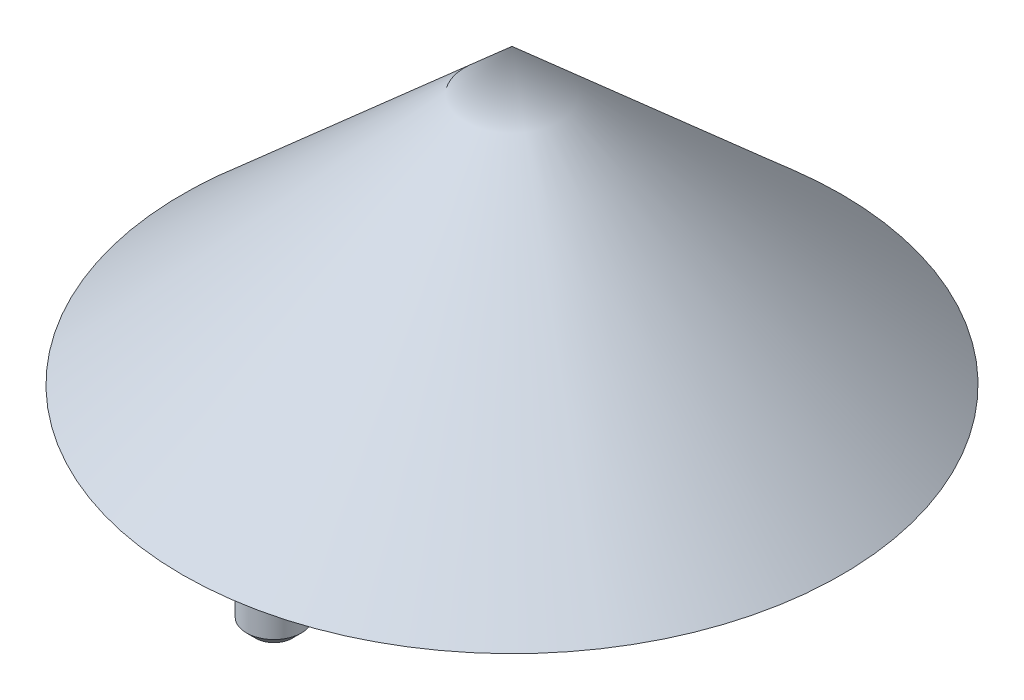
from build123d import *

# Parameters (mm, degrees)
SKETCH_3_R      = 1.5
EXTRUDE_1_DEPTH = 5
CHAMFER_1_SIZE  = 0.5


with BuildPart() as part:
    # Sketch 2 → Revolve 1 (revolve)
    with BuildSketch(Plane.XY, mode=Mode.PRIVATE) as revolve_1_sk:
        Polygon((0, 0), (0, 16), (18, 0), align=None)
    revolve(revolve_1_sk.sketch.rotate(Axis((0, 0, 0), (0, 1, 0)), 90), axis=Axis((0, 0, 0), (0, 1, 0)))

    # Sketch 3 → Extrude 1 (add)
    with BuildSketch(Plane.XZ):
        with Locations(Location((0, 13, 0), (0, 0, 270))):
            Circle(SKETCH_3_R)
        with Locations(Location((-11.258330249, -6.5, 0), (0, 0, 270))):
            Circle(SKETCH_3_R)
        with Locations(Location((11.258330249, -6.5, 0), (0, 0, 270))):
            Circle(SKETCH_3_R)
    extrude(amount=EXTRUDE_1_DEPTH)

    # Chamfer 1
    chamfer_1_edges = [part.edges().sort_by_distance(p)[0] for p in [
        (-11.258330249, -5, -5),
        (11.258330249, -5, -5),
        (0, -5, 14.5),
    ]]
    chamfer(chamfer_1_edges, length=CHAMFER_1_SIZE)


solid = part.part
